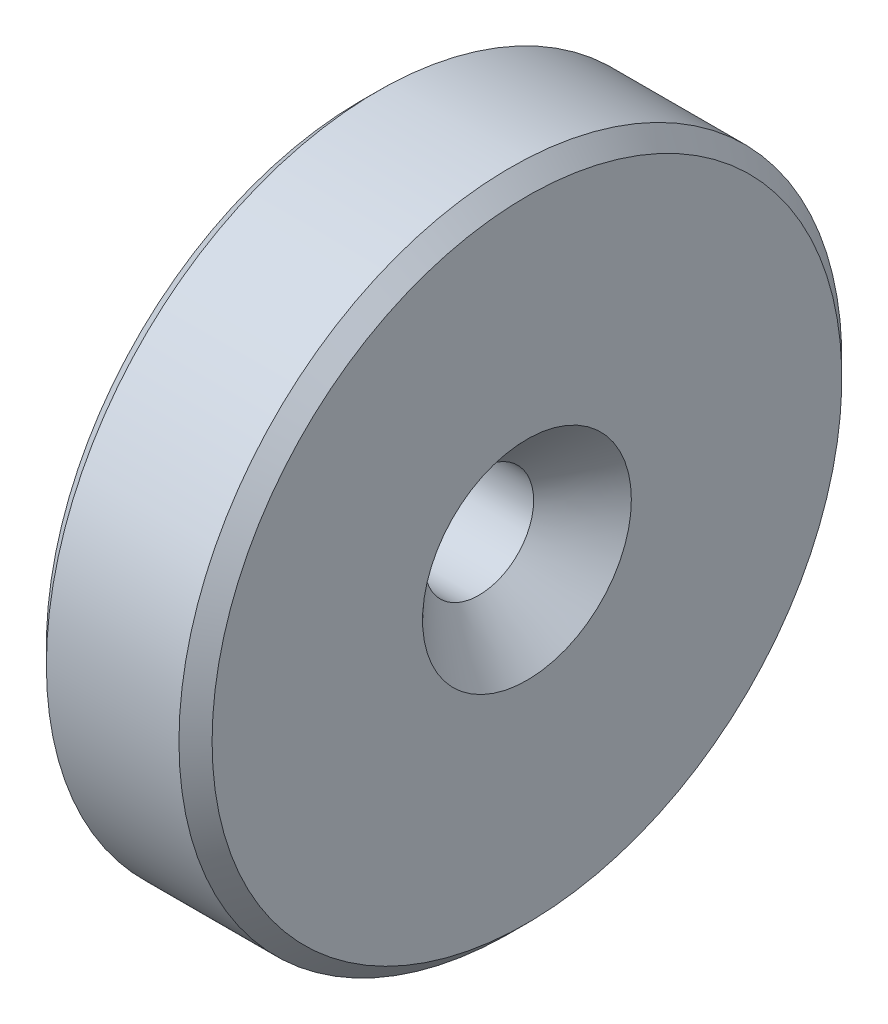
from build123d import *

# Parameters (mm, degrees)
ESQUISSE1_W             = 10
ESQUISSE1_H             = 20
CHANFREIN1_SIZE         = 1
PER_AGE1_D              = 6.6
PER_AGE1_CSINK_D        = 12.6
PER_AGE1_CSINK_ANGLE    = 92
ESQUISSE5_W             = 2.1
ESQUISSE5_H             = 0.25
ENL_V_MAT_EXTRU_1_DEPTH = 20


with BuildPart() as part:
    # Esquisse1 → Base-R_volution (revolve)
    with BuildSketch(Plane.XY, mode=Mode.PRIVATE) as base_r_volution_sk:
        with Locations((5, 10)):
            Rectangle(ESQUISSE1_W, ESQUISSE1_H)
    revolve(base_r_volution_sk.sketch.rotate(Axis((0, 0, 0), (1, 0, 0)), 90), axis=Axis((0, 0, 0), (1, 0, 0)))

    # Chanfrein1
    chanfrein1_edges = [part.edges().sort_by_distance(p)[0] for p in [
        (10, 0, -20),
        (0, 0, -20),
    ]]
    chamfer(chanfrein1_edges, length=CHANFREIN1_SIZE)

    # Per_age1 (through all)
    with Locations(Plane(origin=(10, 0, 0), x_dir=(0, 0, -1), z_dir=(1, 0, 0))):
        with Locations((0, 0)):
            CounterSinkHole(PER_AGE1_D / 2, PER_AGE1_CSINK_D / 2, counter_sink_angle=PER_AGE1_CSINK_ANGLE)

    # Esquisse5 → Enl_v. mat.-Extru.1 (cut, symmetric)
    with BuildSketch(Plane(origin=(0, 0, 0), x_dir=(1, 0, 0), z_dir=(0, 1, 0))):
        with Locations((-0.95, 0)):
            Rectangle(ESQUISSE5_W, ESQUISSE5_H)
    extrude(amount=ENL_V_MAT_EXTRU_1_DEPTH, both=True, mode=Mode.SUBTRACT)


solid = part.part
